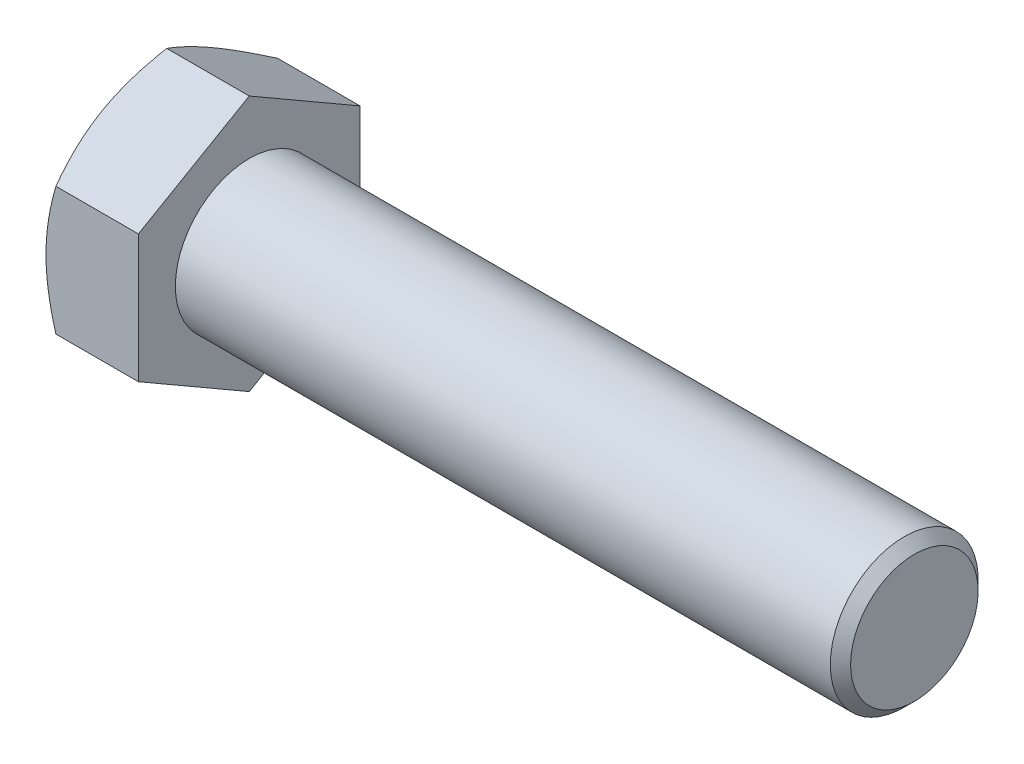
from build123d import *

# Parameters (mm, degrees)
BASEHEAD_DEPTH = 12.5


with BuildPart() as part:
    # Sketch1 → BaseHead (new body)
    with BuildSketch(Plane(origin=(0, 0, 0), x_dir=(0, 0, -1), z_dir=(1, 0, 0))):
        Polygon((15, 8.660254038), (15, -8.660254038), (0, -17.320508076), (-15, -8.660254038), (-15, 8.660254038), (0, 17.320508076), align=None)
    extrude(amount=BASEHEAD_DEPTH)

    # BodySke → BaseBody (revolve)
    with BuildSketch(Plane.XY, mode=Mode.PRIVATE) as basebody_sk:
        Polygon((0, 0), (102.5, 0), (102.5, 8.626), (101.126, 10), (0, 10), align=None)
    revolve(basebody_sk.sketch.rotate(Axis((0, 0, 0), (1, 0, 0)), 90), axis=Axis((0, 0, 0), (1, 0, 0)))

    # Sketch3 → HeadChamfer (revolve, cut)
    with BuildSketch(Plane.XY):
        Polygon((0, 15), (4.226497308, 22.320508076), (4.226497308, 27.320508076), (-10, 27.320508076), (-10, 15), align=None)
    revolve(axis=Axis((0, 0, 0), (1, 0, 0)), mode=Mode.SUBTRACT)


solid = part.part
